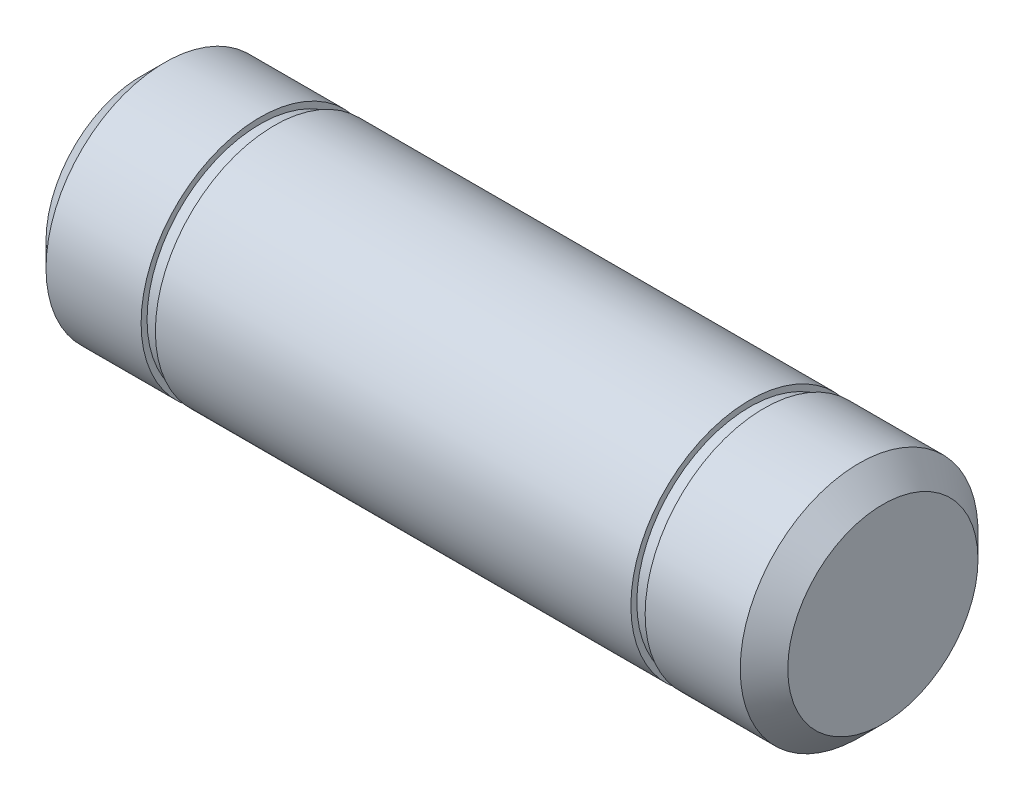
from build123d import *

# Parameters (mm, degrees)
CHANFREIN1_SIZE = 2


with BuildPart() as part:
    # Esquisse1 → R_volution1 (revolve)
    with BuildSketch(Plane.XY, mode=Mode.PRIVATE) as r_volution1_sk:
        Polygon((-74.892483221, 5.751543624), (-74.892483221, 15.751543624), (-64.892483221, 15.751543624), (-64.892483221, 15.251543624), (-63.692483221, 15.251543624), (-63.692483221, 15.751543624), (-23.692483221, 15.751543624), (-23.692483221, 15.251543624), (-22.492483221, 15.251543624), (-22.492483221, 15.751543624), (-12.492483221, 15.751543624), (-12.492483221, 5.751543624), align=None)
    revolve(r_volution1_sk.sketch.rotate(Axis((-112.896778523, 5.751543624, 0), (1, 0, 0)), 90), axis=Axis((-112.896778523, 5.751543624, 0), (1, 0, 0)))

    # Chanfrein1
    chanfrein1_edges = [part.edges().sort_by_distance(p)[0] for p in [
        (-74.892483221, 5.751543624, -10),
        (-12.492483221, 5.751543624, -10),
    ]]
    chamfer(chanfrein1_edges, length=CHANFREIN1_SIZE)


solid = part.part
